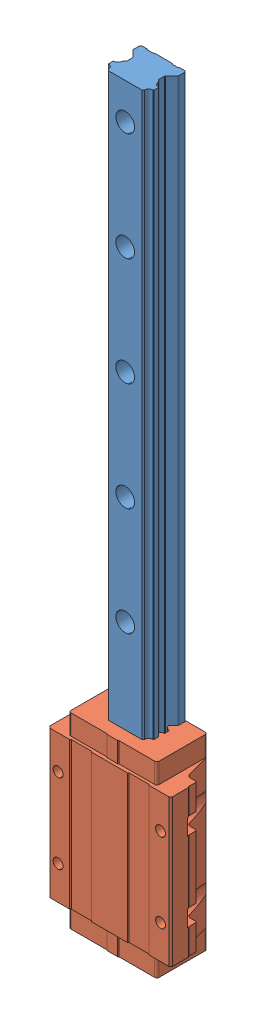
SolidWorks assembly HLW45HC1R1000 E=27.5.step.sldasm, configuration 默认 (file format 13000). Lengths in mm.
Overall size (170 1039.2 75).
2 component instances, 2 part files, 0 mates.
Components (placement in the parent):
- HLR45R1000 E=27.5-1: HLR45R1000 E=27.5.SLDPRT [默认] at origin size (63 1000 53)
- HLW45HC-1: HLW45HC.SLDPRT [默认] at (0 90.6 22) size (170 259.6 75)
